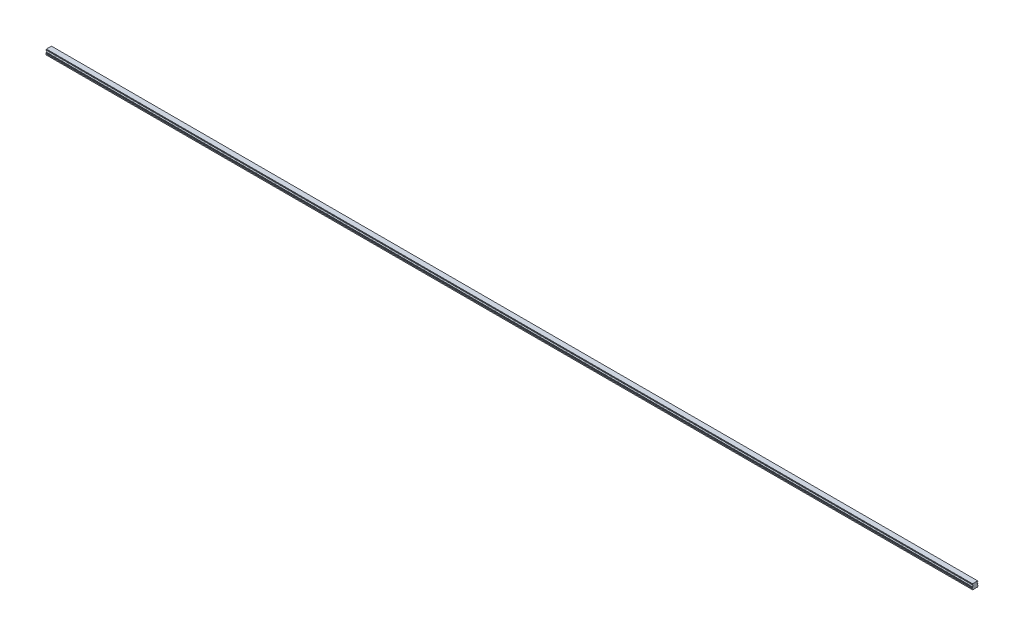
from build123d import *

# Parameters (mm, degrees)
BOSS_EXTRUDE1_DEPTH        = 2400
SKETCH3_R                  = 2.5
SKETCH3_R_2                = 2.1
CUT_EXTRUDE3_DEPTH         = 7
SKETCH3_2_R                = 2.1
CUT_EXTRUDE4_DEPTH         = 9.5
CHAMFER1_SIZE              = 0.4
LPATTERN2_COUNT            = 40
LPATTERN2_PITCH            = 60
CHAMFER1_OF_LPATTERN2_SIZE = 0.4


with BuildPart() as part:
    # Sketch1 → Boss-Extrude1 (new body)
    with BuildSketch(Plane(origin=(0, 0, 0), x_dir=(0, 0, -1), z_dir=(1, 0, 0))):
        with BuildLine():
            Line((6.59, 14), (-6.59, 14))
            Line((-6.59, 14), (-6.59, 13.15))
            Line((-6.59, 13.15), (-6.96, 12.356532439))
            Line((-6.96, 12.356532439), (-6.96, 11.435174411))
            ThreePointArc((-6.96, 11.435174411), (-5.25, 9.5), (-6.96, 7.564825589))
            Line((-6.96, 7.564825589), (-6.96, 6.643467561))
            Line((-6.96, 6.643467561), (-6.59, 5.85))
            Line((-6.59, 5.85), (-7.032116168, 4.2))
            Line((-7.032116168, 4.2), (-7.5, 3.929867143))
            Line((-7.5, 3.929867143), (-7.5, 1.4))
            Line((-7.5, 1.4), (-6.1, 0))
            Line((-6.1, 0), (-3.65, 0))
            Line((-3.65, 0), (-3.25, 0.4))
            Line((-3.25, 0.4), (3.25, 0.4))
            Line((3.25, 0.4), (3.65, 0))
            Line((3.65, 0), (6.1, 0))
            Line((6.1, 0), (7.5, 1.4))
            Line((7.5, 1.4), (7.5, 3.929867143))
            Line((7.5, 3.929867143), (7.032116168, 4.2))
            Line((7.032116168, 4.2), (6.59, 5.85))
            Line((6.59, 5.85), (6.96, 6.643467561))
            Line((6.96, 6.643467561), (6.96, 7.564825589))
            ThreePointArc((6.96, 7.564825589), (5.25, 9.5), (6.96, 11.435174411))
            Line((6.96, 11.435174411), (6.96, 12.356532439))
            Line((6.96, 12.356532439), (6.59, 13.15))
            Line((6.59, 13.15), (6.59, 14))
        make_face()
    extrude(amount=BOSS_EXTRUDE1_DEPTH)

    # Sketch3 → Cut-Extrude3 (cut)
    with BuildSketch(Plane.XZ):
        with Locations(Location((30, 0, 0), (0, 0, 270))):
            Circle(SKETCH3_R)
        with Locations(Location((30, 0, 0), (0, 0, 270))):
            Circle(SKETCH3_R_2, mode=Mode.SUBTRACT)
    cut_extrude3 = extrude(amount=-CUT_EXTRUDE3_DEPTH, mode=Mode.SUBTRACT)

    # Sketch3_2 → Cut-Extrude4 (cut)
    with BuildSketch(Plane.XZ):
        with Locations(Location((30, 0, 0), (0, 0, 270))):
            Circle(SKETCH3_2_R)
    cut_extrude4 = extrude(amount=-CUT_EXTRUDE4_DEPTH, mode=Mode.SUBTRACT)

    # Cut-Extrude5 cone 1 section (on through the dimple's axis) → Cut-Extrude5 (revolve, cut)
    with BuildSketch(Plane(origin=(30, 9.5, 0), x_dir=(0, 0, -1), z_dir=(1, 0, 0))):
        Polygon((0, 0), (2.1, 0), (0, 1.212435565), align=None)
    revolve(axis=Axis((30, 9.5, 0), (0, 1, 0)), mode=Mode.SUBTRACT)

    # Chamfer1
    chamfer1_edges = [part.edges().sort_by_distance(p)[0] for p in [
        (30, 0.4, 2.5),
    ]]
    chamfer(chamfer1_edges, length=CHAMFER1_SIZE)

    # LPattern2: Cut-Extrude3, Cut-Extrude4 ×40
    with Locations(*[(i * LPATTERN2_PITCH, 0, 0) for i in range(1, LPATTERN2_COUNT)]):
        add(cut_extrude3, mode=Mode.SUBTRACT)
        add(cut_extrude4, mode=Mode.SUBTRACT)

    # Chamfer1 of LPattern2
    chamfer1_of_lpattern2_edges = [part.edges().sort_by_distance(p)[0] for p in [
        (90, 0.4, 2.5),
        (150, 0.4, 2.5),
        (210, 0.4, 2.5),
        (270, 0.4, 2.5),
        (330, 0.4, 2.5),
        (390, 0.4, 2.5),
        (450, 0.4, 2.5),
        (510, 0.4, 2.5),
        (570, 0.4, 2.5),
        (630, 0.4, 2.5),
        (690, 0.4, 2.5),
        (750, 0.4, 2.5),
        (810, 0.4, 2.5),
        (870, 0.4, 2.5),
        (930, 0.4, 2.5),
        (990, 0.4, 2.5),
        (1050, 0.4, 2.5),
        (1110, 0.4, 2.5),
        (1170, 0.4, 2.5),
        (1230, 0.4, 2.5),
        (1290, 0.4, 2.5),
        (1350, 0.4, 2.5),
        (1410, 0.4, 2.5),
        (1470, 0.4, 2.5),
        (1530, 0.4, 2.5),
        (1590, 0.4, 2.5),
        (1650, 0.4, 2.5),
        (1710, 0.4, 2.5),
        (1770, 0.4, 2.5),
        (1830, 0.4, 2.5),
        (1890, 0.4, 2.5),
        (1950, 0.4, 2.5),
        (2010, 0.4, 2.5),
        (2070, 0.4, 2.5),
        (2130, 0.4, 2.5),
        (2190, 0.4, 2.5),
        (2250, 0.4, 2.5),
        (2310, 0.4, 2.5),
        (2370, 0.4, 2.5),
    ]]
    chamfer(chamfer1_of_lpattern2_edges, length=CHAMFER1_OF_LPATTERN2_SIZE)


solid = part.part
